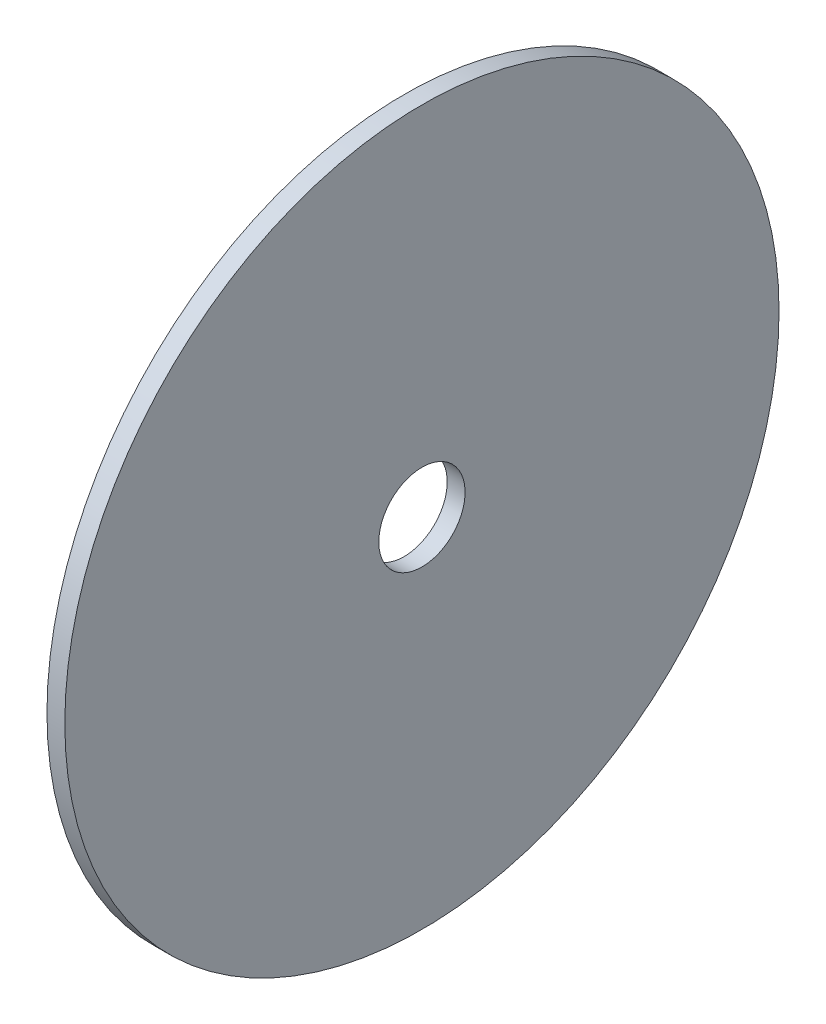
ISO-10303-21;
HEADER;
FILE_DESCRIPTION(('STEP AP214'),'2;1');
FILE_NAME('part.step','',(''),(''),'','','');
FILE_SCHEMA(('AUTOMOTIVE_DESIGN { 1 0 10303 214 1 1 1 1 }'));
ENDSEC;
DATA;
#1=APPLICATION_CONTEXT('core data for automotive mechanical design processes');
#2=APPLICATION_PROTOCOL_DEFINITION('international standard','automotive_design',2000,#1);
#3=PRODUCT_CONTEXT('',#1,'mechanical');
#4=PRODUCT('Part','Part','',(#3));
#5=PRODUCT_RELATED_PRODUCT_CATEGORY('part','',(#4));
#6=PRODUCT_DEFINITION_FORMATION('','',#4);
#7=PRODUCT_DEFINITION_CONTEXT('part definition',#1,'design');
#8=PRODUCT_DEFINITION('design','',#6,#7);
#9=PRODUCT_DEFINITION_SHAPE('','',#8);
#10=(LENGTH_UNIT() NAMED_UNIT(*) SI_UNIT(.MILLI.,.METRE.));
#11=(NAMED_UNIT(*) PLANE_ANGLE_UNIT() SI_UNIT($,.RADIAN.));
#12=(NAMED_UNIT(*) SI_UNIT($,.STERADIAN.) SOLID_ANGLE_UNIT());
#13=UNCERTAINTY_MEASURE_WITH_UNIT(LENGTH_MEASURE(1.E-05),#10,'distance_accuracy_value','');
#14=(GEOMETRIC_REPRESENTATION_CONTEXT(3) GLOBAL_UNCERTAINTY_ASSIGNED_CONTEXT((#13)) GLOBAL_UNIT_ASSIGNED_CONTEXT((#10,
#11,#12)) REPRESENTATION_CONTEXT('',''));
#15=CARTESIAN_POINT('',(0.,0.,0.));
#16=DIRECTION('',(0.,0.,1.));
#17=DIRECTION('',(1.,0.,0.));
#18=AXIS2_PLACEMENT_3D('',#15,#16,#17);
#19=CARTESIAN_POINT('',(0.,0.,-59.9999999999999));
#20=DIRECTION('',(1.,0.,0.));
#21=DIRECTION('',(0.,0.,-1.));
#22=AXIS2_PLACEMENT_3D('',#19,#20,#21);
#23=PLANE('',#22);
#24=CARTESIAN_POINT('',(0.,0.,0.));
#25=DIRECTION('',(-1.,0.,0.));
#26=DIRECTION('',(0.,0.,1.));
#27=AXIS2_PLACEMENT_3D('',#24,#25,#26);
#28=CIRCLE('',#27,7.25);
#29=CARTESIAN_POINT('',(0.,0.,7.25));
#30=VERTEX_POINT('',#29);
#31=EDGE_CURVE('E10',#30,#30,#28,.T.);
#32=ORIENTED_EDGE('',*,*,#31,.F.);
#33=EDGE_LOOP('',(#32));
#34=FACE_BOUND('',#33,.T.);
#35=CARTESIAN_POINT('',(0.,0.,0.));
#36=DIRECTION('',(-1.,0.,0.));
#37=DIRECTION('',(0.,0.,1.));
#38=AXIS2_PLACEMENT_3D('',#35,#36,#37);
#39=CIRCLE('',#38,59.9999999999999);
#40=CARTESIAN_POINT('',(0.,0.,59.9999999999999));
#41=VERTEX_POINT('',#40);
#42=EDGE_CURVE('E46',#41,#41,#39,.T.);
#43=ORIENTED_EDGE('',*,*,#42,.T.);
#44=EDGE_LOOP('',(#43));
#45=FACE_BOUND('',#44,.T.);
#46=ADVANCED_FACE('F32',(#34,#45),#23,.F.);
#47=CARTESIAN_POINT('',(0.,0.,0.));
#48=DIRECTION('',(-1.,0.,0.));
#49=DIRECTION('',(0.,0.,1.));
#50=AXIS2_PLACEMENT_3D('',#47,#48,#49);
#51=CYLINDRICAL_SURFACE('',#50,7.25);
#52=CARTESIAN_POINT('',(3.00000000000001,0.,0.));
#53=DIRECTION('',(-1.,0.,0.));
#54=DIRECTION('',(0.,0.,1.));
#55=AXIS2_PLACEMENT_3D('',#52,#53,#54);
#56=CIRCLE('',#55,7.25);
#57=CARTESIAN_POINT('',(3.00000000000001,0.,7.25));
#58=VERTEX_POINT('',#57);
#59=EDGE_CURVE('E38',#58,#58,#56,.T.);
#60=ORIENTED_EDGE('',*,*,#59,.F.);
#61=EDGE_LOOP('',(#60));
#62=FACE_BOUND('',#61,.T.);
#63=ORIENTED_EDGE('',*,*,#31,.T.);
#64=EDGE_LOOP('',(#63));
#65=FACE_BOUND('',#64,.T.);
#66=ADVANCED_FACE('F61',(#62,#65),#51,.F.);
#67=CARTESIAN_POINT('',(3.,0.,-60.));
#68=DIRECTION('',(-1.,0.,0.));
#69=DIRECTION('',(0.,0.,1.));
#70=AXIS2_PLACEMENT_3D('',#67,#68,#69);
#71=PLANE('',#70);
#72=CARTESIAN_POINT('',(3.,0.,0.));
#73=DIRECTION('',(-1.,0.,0.));
#74=DIRECTION('',(0.,0.,1.));
#75=AXIS2_PLACEMENT_3D('',#72,#73,#74);
#76=CIRCLE('',#75,60.);
#77=CARTESIAN_POINT('',(3.,0.,60.));
#78=VERTEX_POINT('',#77);
#79=EDGE_CURVE('E42',#78,#78,#76,.T.);
#80=ORIENTED_EDGE('',*,*,#79,.F.);
#81=EDGE_LOOP('',(#80));
#82=FACE_BOUND('',#81,.T.);
#83=ORIENTED_EDGE('',*,*,#59,.T.);
#84=EDGE_LOOP('',(#83));
#85=FACE_BOUND('',#84,.T.);
#86=ADVANCED_FACE('F56',(#82,#85),#71,.F.);
#87=CARTESIAN_POINT('',(0.,0.,0.));
#88=DIRECTION('',(-1.,0.,0.));
#89=DIRECTION('',(0.,0.,1.));
#90=AXIS2_PLACEMENT_3D('',#87,#88,#89);
#91=CYLINDRICAL_SURFACE('',#90,60.);
#92=ORIENTED_EDGE('',*,*,#42,.F.);
#93=EDGE_LOOP('',(#92));
#94=FACE_BOUND('',#93,.T.);
#95=ORIENTED_EDGE('',*,*,#79,.T.);
#96=EDGE_LOOP('',(#95));
#97=FACE_BOUND('',#96,.T.);
#98=ADVANCED_FACE('F53',(#94,#97),#91,.T.);
#99=CLOSED_SHELL('',(#46,#66,#86,#98));
#100=MANIFOLD_SOLID_BREP('B2',#99);
#101=ADVANCED_BREP_SHAPE_REPRESENTATION('',(#18,#100),#14);
#102=SHAPE_DEFINITION_REPRESENTATION(#9,#101);
ENDSEC;
END-ISO-10303-21;
